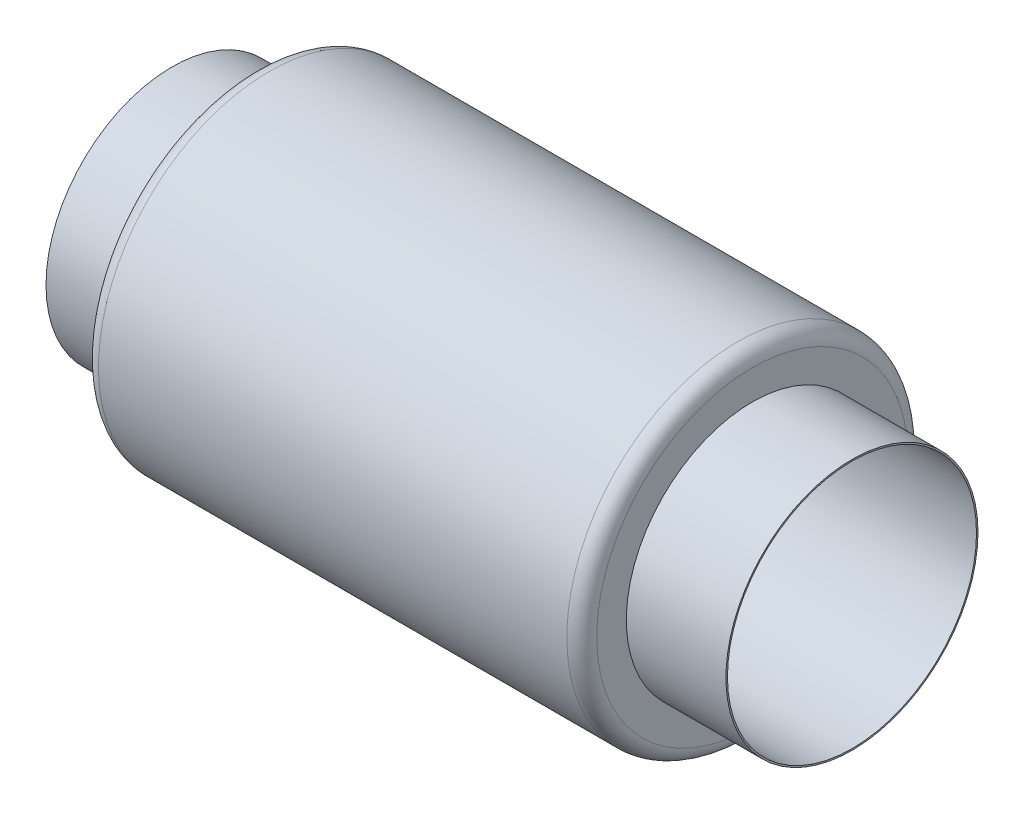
from build123d import *

# Parameters (mm, degrees)
SKETCH1_R           = 12.8524
SKETCH1_R_2         = 12.7
BOSS_EXTRUDE1_DEPTH = 88.9
SKETCH2_R           = 17.399
SKETCH2_R_2         = 12.809013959
BOSS_EXTRUDE2_DEPTH = 50.8
FILLET1_R           = 1.524
SKETCH3_W           = 46.922683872
SKETCH3_H           = 37.292437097
CUT_EXTRUDE1_DEPTH  = 10.668
SKETCH4_W           = 53.083105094
SKETCH4_H           = 43.369296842
CUT_EXTRUDE2_DEPTH  = 8.89


with BuildPart() as part:
    # Sketch1 → Boss-Extrude1 (new body)
    with BuildSketch(Plane(origin=(0, 0, 0), x_dir=(0, 0, -1), z_dir=(1, 0, 0))):
        Circle(SKETCH1_R)
        Circle(SKETCH1_R_2, mode=Mode.SUBTRACT)
    extrude(amount=BOSS_EXTRUDE1_DEPTH)

    # Sketch2 → Boss-Extrude2 (add)
    with BuildSketch(Plane(origin=(19.05, 0, 0), x_dir=(0, 0, -1), z_dir=(1, 0, 0))):
        Circle(SKETCH2_R)
        Circle(SKETCH2_R_2, mode=Mode.SUBTRACT)
    extrude(amount=BOSS_EXTRUDE2_DEPTH)

    # Fillet1
    fillet1_edges = [part.edges().sort_by_distance(p)[0] for p in [
        (69.85, 0, 17.399),
        (19.05, 0, 17.399),
    ]]
    fillet(fillet1_edges, radius=FILLET1_R)

    # Sketch3 → Cut-Extrude1 (cut)
    with BuildSketch(Plane.ZY):
        with Locations((-0.951135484, 0.317045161)):
            Rectangle(SKETCH3_W, SKETCH3_H)
    extrude(amount=-CUT_EXTRUDE1_DEPTH, mode=Mode.SUBTRACT)

    # Sketch4 → Cut-Extrude2 (cut)
    with BuildSketch(Plane(origin=(88.9, 0, 0), x_dir=(0, 0, -1), z_dir=(1, 0, 0))):
        with Locations((-0.485690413, 1.714201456)):
            Rectangle(SKETCH4_W, SKETCH4_H)
    extrude(amount=-CUT_EXTRUDE2_DEPTH, mode=Mode.SUBTRACT)


solid = part.part
